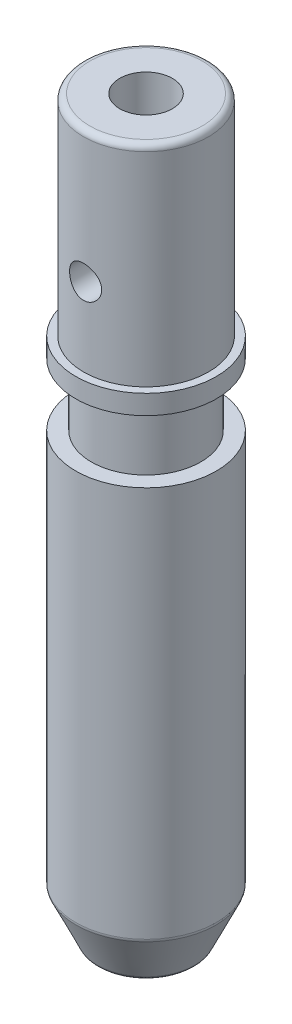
from build123d import *

# Parameters (mm, degrees)
SKETCH1_R                    = 12.7
BOSS_EXTRUDE1_DEPTH          = 42.672
SKETCH2_R                    = 14.2875
BOSS_EXTRUDE2_DEPTH          = 3.937
SKETCH3_R                    = 11.1125
BOSS_EXTRUDE3_DEPTH          = 12.7
SKETCH4_R                    = 14.2875
BOSS_EXTRUDE4_DEPTH          = 89.916
F_1_2_13_TAPPED_HOLE1_D      = 10.71626
F_1_2_13_TAPPED_HOLE1_DEPTH  = 35.179
F_1_2_13_TAPPED_HOLE1_TIP    = 3.219489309
F_5_16_18_TAPPED_HOLE2_D     = 6.5278
F_5_16_18_TAPPED_HOLE2_DEPTH = 12.7
F_5_16_18_TAPPED_HOLE2_TIP   = 1.961148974
CHAMFER1_SIZE                = 10.16
CHAMFER1_SIZE2               = 4.737685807
FILLET1_R                    = 1.27


with BuildPart() as part:
    # Sketch1 → Boss-Extrude1 (new body)
    with BuildSketch(Plane(origin=(0, 0, 0), x_dir=(1, 0, 0), z_dir=(0, 1, 0))):
        with Locations(Location((0, 0, 0), (0, 0, 270))):
            Circle(SKETCH1_R)
    extrude(amount=-BOSS_EXTRUDE1_DEPTH)

    # Sketch2 → Boss-Extrude2 (add)
    with BuildSketch(Plane.XZ.offset(42.672)):
        with Locations(Location((0, 0, 0), (0, 0, 270))):
            Circle(SKETCH2_R)
    extrude(amount=BOSS_EXTRUDE2_DEPTH)

    # Sketch3 → Boss-Extrude3 (add)
    with BuildSketch(Plane.XZ.offset(46.609)):
        with Locations(Location((0, 0, 0), (0, 0, 270))):
            Circle(SKETCH3_R)
    extrude(amount=BOSS_EXTRUDE3_DEPTH)

    # Sketch4 → Boss-Extrude4 (add)
    with BuildSketch(Plane.XZ.offset(59.309)):
        with Locations(Location((0, 0, 0), (0, 0, 270))):
            Circle(SKETCH4_R)
    extrude(amount=BOSS_EXTRUDE4_DEPTH)

    # 1_2-13 Tapped Hole1
    with Locations(Plane(origin=(0, 0, 0), x_dir=(1, 0, 0), z_dir=(0, 1, 0))):
        with Locations((0, 0)):
            Hole(F_1_2_13_TAPPED_HOLE1_D / 2, depth=F_1_2_13_TAPPED_HOLE1_DEPTH)
            with Locations((0, 0, -(F_1_2_13_TAPPED_HOLE1_DEPTH + F_1_2_13_TAPPED_HOLE1_TIP / 2))):  # 118° drill point
                Cone(0, F_1_2_13_TAPPED_HOLE1_D / 2, F_1_2_13_TAPPED_HOLE1_TIP, mode=Mode.SUBTRACT)

    # 5_16-18 Tapped Hole2
    with Locations(Plane(origin=(0, -26.797, 12.7), x_dir=(1, 0, 0), z_dir=(0, 0, 1))):
        with Locations((0, 0)):
            Hole(F_5_16_18_TAPPED_HOLE2_D / 2, depth=F_5_16_18_TAPPED_HOLE2_DEPTH)
            with Locations((0, 0, -(F_5_16_18_TAPPED_HOLE2_DEPTH + F_5_16_18_TAPPED_HOLE2_TIP / 2))):  # 118° drill point
                Cone(0, F_5_16_18_TAPPED_HOLE2_D / 2, F_5_16_18_TAPPED_HOLE2_TIP, mode=Mode.SUBTRACT)

    # Chamfer1
    chamfer1_edges = [part.edges().sort_by_distance(p)[0] for p in [
        (0, -149.225, 14.2875),
    ]]
    chamfer1_side = [part.faces().sort_by_distance(p)[0] for p in [
        (0, -104.267, 14.2875),
    ]]
    chamfer(chamfer1_edges, length=CHAMFER1_SIZE, length2=CHAMFER1_SIZE2, reference=chamfer1_side[0])

    # Fillet1
    fillet1_edges = [part.edges().sort_by_distance(p)[0] for p in [
        (0, 0, -12.7),
        (0, -149.225, 9.549814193),
        (0, -139.065, 14.2875),
    ]]
    fillet(fillet1_edges, radius=FILLET1_R)


solid = part.part
